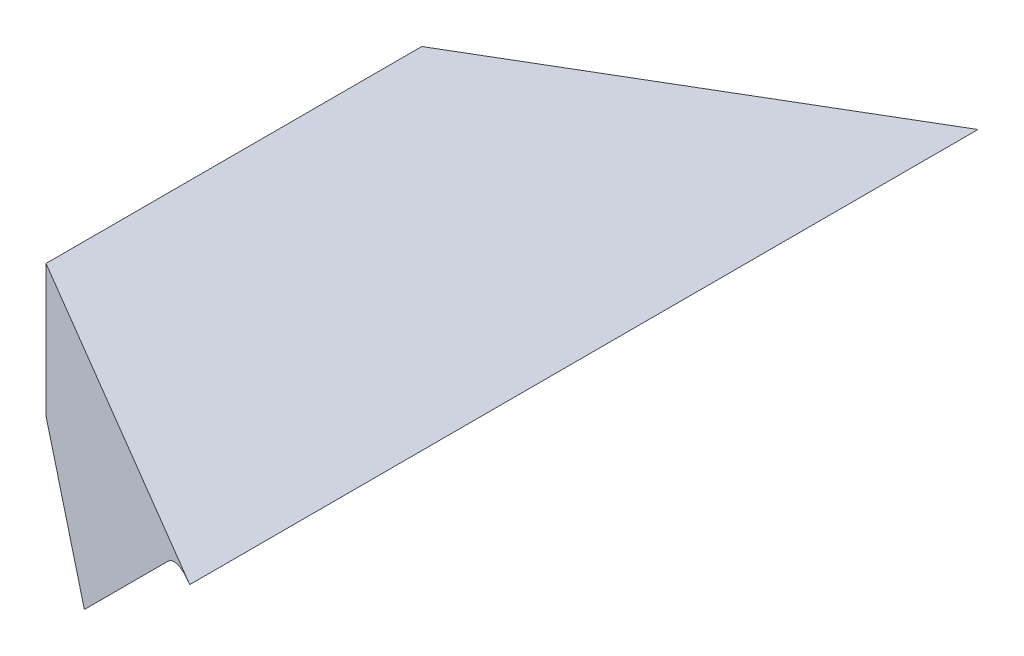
from build123d import *

# Parameters (mm, degrees)
SKETCH1_W           = 50
SKETCH1_H           = 5
BASE_EXTRUDE_DEPTH  = 25
BOSS_EXTRUDE1_DEPTH = 20
CUT_EXTRUDE2_DEPTH  = 38.336309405
FILLET1_R           = 4
SKETCH5_W           = 50
SKETCH5_H           = 5
CUT_EXTRUDE3_DEPTH  = 58.175169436


with BuildPart() as part:
    # Sketch1 → Base-Extrude (new, symmetric)
    with BuildSketch(Plane.XY):
        with Locations((0, 2.5)):
            Rectangle(SKETCH1_W, SKETCH1_H)
    extrude(amount=BASE_EXTRUDE_DEPTH, both=True)

    # Sketch2 → Boss-Extrude1 (add, symmetric)
    with BuildSketch(Plane.XY):
        Polygon((8.485281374, 0), (-3.514718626, -12), (-8.485281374, -7.029437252), (-8.485281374, 0), align=None)
    extrude(amount=BOSS_EXTRUDE1_DEPTH, both=True)

    # Sketch4 → Cut-Extrude2 (cut, through all)
    with BuildSketch(Plane.XZ):
        Polygon((8.485281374, -20), (-8.485281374, -10), (-8.485281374, -20), align=None)
        Polygon((-8.485281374, 20), (8.485281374, 20), (-8.485281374, 10), align=None)
    extrude(amount=CUT_EXTRUDE2_DEPTH, mode=Mode.SUBTRACT)

    # Fillet1
    fillet1_edges = [part.edges().sort_by_distance(p)[0] for p in [
        (8.485281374, 0, 0),
    ]]
    fillet(fillet1_edges, radius=FILLET1_R)

    # Sketch5 → Cut-Extrude3 (cut, through all)
    with BuildSketch(Plane(origin=(25, 0, 0), x_dir=(0, 0, -1), z_dir=(1, 0, 0))):
        with Locations((0, 2.5)):
            Rectangle(SKETCH5_W, SKETCH5_H)
    extrude(amount=-CUT_EXTRUDE3_DEPTH, mode=Mode.SUBTRACT)


solid = part.part
